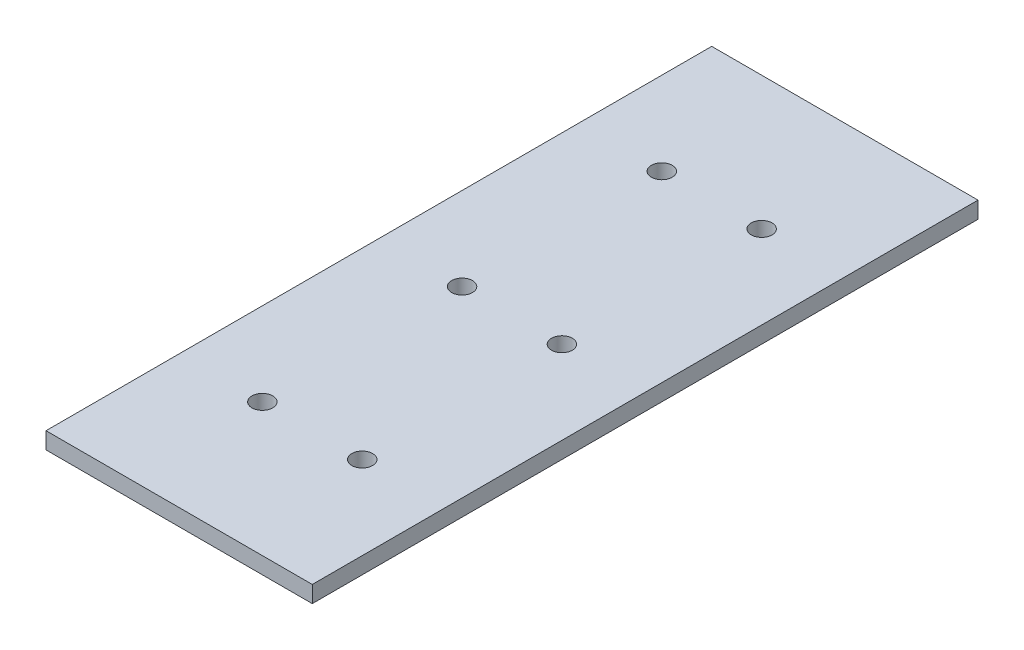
from build123d import *

# Parameters (mm, degrees)
SKETCH1_W      = 101.6
SKETCH1_H      = 6.35
EXTRUDE1_DEPTH = 254
SKETCH2_R      = 3.9751
EXTRUDE2_DEPTH = 6.35


with BuildPart() as part:
    # Sketch1 → Extrude1 (new body)
    with BuildSketch(Plane.XY):
        Rectangle(SKETCH1_W, SKETCH1_H)
    extrude(amount=EXTRUDE1_DEPTH)

    # Sketch2 → Extrude2 (cut)
    with BuildSketch(Plane(origin=(0, 3.175, 0), x_dir=(1, 0, 0), z_dir=(0, 1, 0))):
        with Locations(Location((-19.05, -50.8, 0), (0, 0, 180))):
            Circle(SKETCH2_R)
        with Locations(Location((19.05, -50.8, 0), (0, 0, 180))):
            Circle(SKETCH2_R)
        with Locations(Location((-19.05, -127, 0), (0, 0, 180))):
            Circle(SKETCH2_R)
        with Locations(Location((19.05, -127, 0), (0, 0, 180))):
            Circle(SKETCH2_R)
        with Locations(Location((-19.05, -203.2, 0), (0, 0, 180))):
            Circle(SKETCH2_R)
        with Locations(Location((19.05, -203.2, 0), (0, 0, 180))):
            Circle(SKETCH2_R)
    extrude(amount=-EXTRUDE2_DEPTH, mode=Mode.SUBTRACT)


solid = part.part
